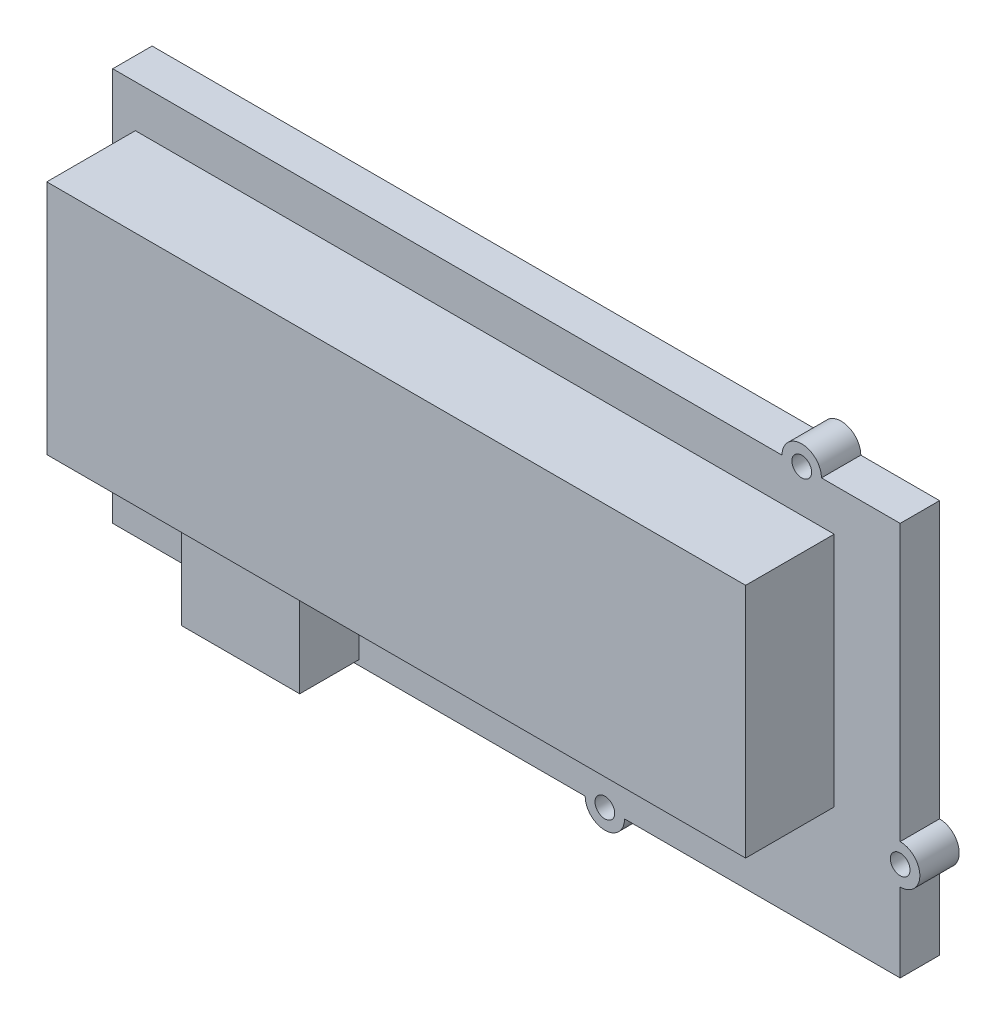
ISO-10303-21;
HEADER;
FILE_DESCRIPTION(('STEP AP214'),'2;1');
FILE_NAME('part.step','',(''),(''),'','','');
FILE_SCHEMA(('AUTOMOTIVE_DESIGN { 1 0 10303 214 1 1 1 1 }'));
ENDSEC;
DATA;
#1=APPLICATION_CONTEXT('core data for automotive mechanical design processes');
#2=APPLICATION_PROTOCOL_DEFINITION('international standard','automotive_design',2000,#1);
#3=PRODUCT_CONTEXT('',#1,'mechanical');
#4=PRODUCT('Part','Part','',(#3));
#5=PRODUCT_RELATED_PRODUCT_CATEGORY('part','',(#4));
#6=PRODUCT_DEFINITION_FORMATION('','',#4);
#7=PRODUCT_DEFINITION_CONTEXT('part definition',#1,'design');
#8=PRODUCT_DEFINITION('design','',#6,#7);
#9=PRODUCT_DEFINITION_SHAPE('','',#8);
#10=(LENGTH_UNIT() NAMED_UNIT(*) SI_UNIT(.MILLI.,.METRE.));
#11=(NAMED_UNIT(*) PLANE_ANGLE_UNIT() SI_UNIT($,.RADIAN.));
#12=(NAMED_UNIT(*) SI_UNIT($,.STERADIAN.) SOLID_ANGLE_UNIT());
#13=UNCERTAINTY_MEASURE_WITH_UNIT(LENGTH_MEASURE(1.E-05),#10,'distance_accuracy_value','');
#14=(GEOMETRIC_REPRESENTATION_CONTEXT(3) GLOBAL_UNCERTAINTY_ASSIGNED_CONTEXT((#13)) GLOBAL_UNIT_ASSIGNED_CONTEXT((#10,
#11,#12)) REPRESENTATION_CONTEXT('',''));
#15=CARTESIAN_POINT('',(0.,0.,0.));
#16=DIRECTION('',(0.,0.,1.));
#17=DIRECTION('',(1.,0.,0.));
#18=AXIS2_PLACEMENT_3D('',#15,#16,#17);
#19=CARTESIAN_POINT('',(0.,0.,4.));
#20=DIRECTION('',(0.,0.,-1.));
#21=DIRECTION('',(-1.,0.,0.));
#22=AXIS2_PLACEMENT_3D('',#19,#20,#21);
#23=PLANE('',#22);
#24=DIRECTION('',(0.,-1.,0.));
#25=VECTOR('',#24,1.);
#26=CARTESIAN_POINT('',(2.3,35.7,4.));
#27=LINE('',#26,#25);
#28=CARTESIAN_POINT('',(2.3,35.7,4.));
#29=VERTEX_POINT('',#28);
#30=CARTESIAN_POINT('',(2.3,11.7,4.));
#31=VERTEX_POINT('',#30);
#32=EDGE_CURVE('E205',#29,#31,#27,.T.);
#33=ORIENTED_EDGE('',*,*,#32,.F.);
#34=DIRECTION('',(-1.,0.,0.));
#35=VECTOR('',#34,1.);
#36=CARTESIAN_POINT('',(2.3,35.7,4.));
#37=LINE('',#36,#35);
#38=CARTESIAN_POINT('',(73.3,35.7,4.));
#39=VERTEX_POINT('',#38);
#40=EDGE_CURVE('E218',#39,#29,#37,.T.);
#41=ORIENTED_EDGE('',*,*,#40,.F.);
#42=DIRECTION('',(0.,1.,0.));
#43=VECTOR('',#42,1.);
#44=CARTESIAN_POINT('',(73.3,35.7,4.));
#45=LINE('',#44,#43);
#46=CARTESIAN_POINT('',(73.3,11.7,4.));
#47=VERTEX_POINT('',#46);
#48=EDGE_CURVE('E227',#47,#39,#45,.T.);
#49=ORIENTED_EDGE('',*,*,#48,.F.);
#50=DIRECTION('',(1.,0.,0.));
#51=VECTOR('',#50,1.);
#52=CARTESIAN_POINT('',(2.3,11.7,4.));
#53=LINE('',#52,#51);
#54=EDGE_CURVE('E208',#31,#47,#53,.T.);
#55=ORIENTED_EDGE('',*,*,#54,.F.);
#56=EDGE_LOOP('',(#33,#41,#49,#55));
#57=FACE_BOUND('',#56,.T.);
#58=CARTESIAN_POINT('',(50.,0.,4.));
#59=DIRECTION('',(0.,0.,1.));
#60=DIRECTION('',(1.,0.,0.));
#61=AXIS2_PLACEMENT_3D('',#58,#59,#60);
#62=CIRCLE('',#61,0.999999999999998);
#63=CARTESIAN_POINT('',(51.,0.,4.));
#64=VERTEX_POINT('',#63);
#65=EDGE_CURVE('E243',#64,#64,#62,.T.);
#66=ORIENTED_EDGE('',*,*,#65,.F.);
#67=EDGE_LOOP('',(#66));
#68=FACE_BOUND('',#67,.T.);
#69=CARTESIAN_POINT('',(10.,0.,4.));
#70=DIRECTION('',(0.,0.,1.));
#71=DIRECTION('',(1.,0.,0.));
#72=AXIS2_PLACEMENT_3D('',#69,#70,#71);
#73=CIRCLE('',#72,1.37675009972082);
#74=CARTESIAN_POINT('',(11.3767500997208,0.,4.));
#75=VERTEX_POINT('',#74);
#76=EDGE_CURVE('E247',#75,#75,#73,.T.);
#77=ORIENTED_EDGE('',*,*,#76,.F.);
#78=EDGE_LOOP('',(#77));
#79=FACE_BOUND('',#78,.T.);
#80=CARTESIAN_POINT('',(80.,10.,4.));
#81=DIRECTION('',(0.,0.,1.));
#82=DIRECTION('',(1.,0.,0.));
#83=AXIS2_PLACEMENT_3D('',#80,#81,#82);
#84=CIRCLE('',#83,0.999999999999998);
#85=CARTESIAN_POINT('',(81.,10.,4.));
#86=VERTEX_POINT('',#85);
#87=EDGE_CURVE('E253',#86,#86,#84,.T.);
#88=ORIENTED_EDGE('',*,*,#87,.F.);
#89=EDGE_LOOP('',(#88));
#90=FACE_BOUND('',#89,.T.);
#91=CARTESIAN_POINT('',(70.,40.,4.));
#92=DIRECTION('',(0.,0.,1.));
#93=DIRECTION('',(1.,0.,0.));
#94=AXIS2_PLACEMENT_3D('',#91,#92,#93);
#95=CIRCLE('',#94,0.999999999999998);
#96=CARTESIAN_POINT('',(71.,40.,4.));
#97=VERTEX_POINT('',#96);
#98=EDGE_CURVE('E259',#97,#97,#95,.T.);
#99=ORIENTED_EDGE('',*,*,#98,.F.);
#100=EDGE_LOOP('',(#99));
#101=FACE_BOUND('',#100,.T.);
#102=CARTESIAN_POINT('',(0.,30.,4.));
#103=DIRECTION('',(0.,0.,1.));
#104=DIRECTION('',(1.,0.,0.));
#105=AXIS2_PLACEMENT_3D('',#102,#103,#104);
#106=CIRCLE('',#105,1.);
#107=CARTESIAN_POINT('',(1.,30.,4.));
#108=VERTEX_POINT('',#107);
#109=EDGE_CURVE('E265',#108,#108,#106,.T.);
#110=ORIENTED_EDGE('',*,*,#109,.F.);
#111=EDGE_LOOP('',(#110));
#112=FACE_BOUND('',#111,.T.);
#113=DIRECTION('',(1.,0.,0.));
#114=VECTOR('',#113,1.);
#115=CARTESIAN_POINT('',(0.,0.,4.));
#116=LINE('',#115,#114);
#117=CARTESIAN_POINT('',(0.,0.,4.));
#118=VERTEX_POINT('',#117);
#119=CARTESIAN_POINT('',(8.,0.,4.));
#120=VERTEX_POINT('',#119);
#121=EDGE_CURVE('E329',#118,#120,#116,.T.);
#122=ORIENTED_EDGE('',*,*,#121,.T.);
#123=CARTESIAN_POINT('',(10.,0.,4.));
#124=DIRECTION('',(0.,0.,1.));
#125=DIRECTION('',(1.,0.,0.));
#126=AXIS2_PLACEMENT_3D('',#123,#124,#125);
#127=CIRCLE('',#126,2.);
#128=CARTESIAN_POINT('',(12.,0.,4.));
#129=VERTEX_POINT('',#128);
#130=EDGE_CURVE('E271',#120,#129,#127,.T.);
#131=ORIENTED_EDGE('',*,*,#130,.T.);
#132=CARTESIAN_POINT('',(48.,0.,4.));
#133=VERTEX_POINT('',#132);
#134=EDGE_CURVE('E333',#129,#133,#116,.T.);
#135=ORIENTED_EDGE('',*,*,#134,.T.);
#136=CARTESIAN_POINT('',(50.,0.,4.));
#137=DIRECTION('',(0.,0.,1.));
#138=DIRECTION('',(1.,0.,0.));
#139=AXIS2_PLACEMENT_3D('',#136,#137,#138);
#140=CIRCLE('',#139,2.);
#141=CARTESIAN_POINT('',(52.,0.,4.));
#142=VERTEX_POINT('',#141);
#143=EDGE_CURVE('E283',#133,#142,#140,.T.);
#144=ORIENTED_EDGE('',*,*,#143,.T.);
#145=CARTESIAN_POINT('',(80.,0.,4.));
#146=VERTEX_POINT('',#145);
#147=EDGE_CURVE('E327',#142,#146,#116,.T.);
#148=ORIENTED_EDGE('',*,*,#147,.T.);
#149=DIRECTION('',(0.,1.,0.));
#150=VECTOR('',#149,1.);
#151=CARTESIAN_POINT('',(80.,0.,4.));
#152=LINE('',#151,#150);
#153=CARTESIAN_POINT('',(80.,8.,4.));
#154=VERTEX_POINT('',#153);
#155=EDGE_CURVE('E334',#146,#154,#152,.T.);
#156=ORIENTED_EDGE('',*,*,#155,.T.);
#157=CARTESIAN_POINT('',(80.,10.,4.));
#158=DIRECTION('',(0.,0.,1.));
#159=DIRECTION('',(1.,0.,0.));
#160=AXIS2_PLACEMENT_3D('',#157,#158,#159);
#161=CIRCLE('',#160,2.);
#162=CARTESIAN_POINT('',(80.,12.,4.));
#163=VERTEX_POINT('',#162);
#164=EDGE_CURVE('E293',#154,#163,#161,.T.);
#165=ORIENTED_EDGE('',*,*,#164,.T.);
#166=CARTESIAN_POINT('',(80.,40.,4.));
#167=VERTEX_POINT('',#166);
#168=EDGE_CURVE('E332',#163,#167,#152,.T.);
#169=ORIENTED_EDGE('',*,*,#168,.T.);
#170=DIRECTION('',(-1.,0.,0.));
#171=VECTOR('',#170,1.);
#172=CARTESIAN_POINT('',(0.,40.,4.));
#173=LINE('',#172,#171);
#174=CARTESIAN_POINT('',(72.,40.,4.));
#175=VERTEX_POINT('',#174);
#176=EDGE_CURVE('E338',#167,#175,#173,.T.);
#177=ORIENTED_EDGE('',*,*,#176,.T.);
#178=CARTESIAN_POINT('',(70.,40.,4.));
#179=DIRECTION('',(0.,0.,1.));
#180=DIRECTION('',(1.,0.,0.));
#181=AXIS2_PLACEMENT_3D('',#178,#179,#180);
#182=CIRCLE('',#181,2.);
#183=CARTESIAN_POINT('',(68.,40.,4.));
#184=VERTEX_POINT('',#183);
#185=EDGE_CURVE('E303',#175,#184,#182,.T.);
#186=ORIENTED_EDGE('',*,*,#185,.T.);
#187=CARTESIAN_POINT('',(0.,40.,4.));
#188=VERTEX_POINT('',#187);
#189=EDGE_CURVE('E337',#184,#188,#173,.T.);
#190=ORIENTED_EDGE('',*,*,#189,.T.);
#191=DIRECTION('',(0.,-1.,0.));
#192=VECTOR('',#191,1.);
#193=CARTESIAN_POINT('',(0.,0.,4.));
#194=LINE('',#193,#192);
#195=CARTESIAN_POINT('',(0.,32.,4.));
#196=VERTEX_POINT('',#195);
#197=EDGE_CURVE('E324',#188,#196,#194,.T.);
#198=ORIENTED_EDGE('',*,*,#197,.T.);
#199=CARTESIAN_POINT('',(0.,30.,4.));
#200=DIRECTION('',(0.,0.,1.));
#201=DIRECTION('',(1.,0.,0.));
#202=AXIS2_PLACEMENT_3D('',#199,#200,#201);
#203=CIRCLE('',#202,2.);
#204=CARTESIAN_POINT('',(0.,28.,4.));
#205=VERTEX_POINT('',#204);
#206=EDGE_CURVE('E313',#196,#205,#203,.T.);
#207=ORIENTED_EDGE('',*,*,#206,.T.);
#208=EDGE_CURVE('E328',#205,#118,#194,.T.);
#209=ORIENTED_EDGE('',*,*,#208,.T.);
#210=EDGE_LOOP('',(#122,#131,#135,#144,#148,#156,#165,#169,#177,#186,#190,#198,#207,#209));
#211=FACE_BOUND('',#210,.T.);
#212=DIRECTION('',(0.,-1.,0.));
#213=VECTOR('',#212,1.);
#214=CARTESIAN_POINT('',(13.,10.5,4.));
#215=LINE('',#214,#213);
#216=CARTESIAN_POINT('',(13.,10.5,4.));
#217=VERTEX_POINT('',#216);
#218=CARTESIAN_POINT('',(13.,0.5,4.));
#219=VERTEX_POINT('',#218);
#220=EDGE_CURVE('E204',#217,#219,#215,.T.);
#221=ORIENTED_EDGE('',*,*,#220,.F.);
#222=DIRECTION('',(-1.,0.,0.));
#223=VECTOR('',#222,1.);
#224=CARTESIAN_POINT('',(13.,10.5,4.));
#225=LINE('',#224,#223);
#226=CARTESIAN_POINT('',(25.,10.5,4.));
#227=VERTEX_POINT('',#226);
#228=EDGE_CURVE('E201',#227,#217,#225,.T.);
#229=ORIENTED_EDGE('',*,*,#228,.F.);
#230=DIRECTION('',(0.,1.,0.));
#231=VECTOR('',#230,1.);
#232=CARTESIAN_POINT('',(25.,10.5,4.));
#233=LINE('',#232,#231);
#234=CARTESIAN_POINT('',(25.,0.5,4.));
#235=VERTEX_POINT('',#234);
#236=EDGE_CURVE('E55',#235,#227,#233,.T.);
#237=ORIENTED_EDGE('',*,*,#236,.F.);
#238=DIRECTION('',(1.,0.,0.));
#239=VECTOR('',#238,1.);
#240=CARTESIAN_POINT('',(13.,0.5,4.));
#241=LINE('',#240,#239);
#242=EDGE_CURVE('E50',#219,#235,#241,.T.);
#243=ORIENTED_EDGE('',*,*,#242,.F.);
#244=EDGE_LOOP('',(#221,#229,#237,#243));
#245=FACE_BOUND('',#244,.T.);
#246=ADVANCED_FACE('F35',(#57,#68,#79,#90,#101,#112,#211,#245),#23,.F.);
#247=CARTESIAN_POINT('',(0.,0.,4.));
#248=DIRECTION('',(0.,1.,0.));
#249=DIRECTION('',(0.,0.,1.));
#250=AXIS2_PLACEMENT_3D('',#247,#248,#249);
#251=PLANE('',#250);
#252=DIRECTION('',(1.,0.,0.));
#253=VECTOR('',#252,1.);
#254=CARTESIAN_POINT('',(0.,0.,0.));
#255=LINE('',#254,#253);
#256=CARTESIAN_POINT('',(0.,0.,0.));
#257=VERTEX_POINT('',#256);
#258=CARTESIAN_POINT('',(8.,0.,0.));
#259=VERTEX_POINT('',#258);
#260=EDGE_CURVE('E346',#257,#259,#255,.T.);
#261=ORIENTED_EDGE('',*,*,#260,.T.);
#262=DIRECTION('',(0.,0.,1.));
#263=VECTOR('',#262,1.);
#264=CARTESIAN_POINT('',(8.,0.,0.));
#265=LINE('',#264,#263);
#266=EDGE_CURVE('E280',#259,#120,#265,.T.);
#267=ORIENTED_EDGE('',*,*,#266,.T.);
#268=ORIENTED_EDGE('',*,*,#121,.F.);
#269=DIRECTION('',(0.,0.,-1.));
#270=VECTOR('',#269,1.);
#271=CARTESIAN_POINT('',(0.,0.,4.));
#272=LINE('',#271,#270);
#273=EDGE_CURVE('E11',#118,#257,#272,.T.);
#274=ORIENTED_EDGE('',*,*,#273,.T.);
#275=EDGE_LOOP('',(#261,#267,#268,#274));
#276=FACE_BOUND('',#275,.T.);
#277=ADVANCED_FACE('F399',(#276),#251,.F.);
#278=ORIENTED_EDGE('',*,*,#134,.F.);
#279=DIRECTION('',(0.,0.,1.));
#280=VECTOR('',#279,1.);
#281=CARTESIAN_POINT('',(12.,0.,0.));
#282=LINE('',#281,#280);
#283=CARTESIAN_POINT('',(12.,0.,0.));
#284=VERTEX_POINT('',#283);
#285=EDGE_CURVE('E276',#129,#284,#282,.F.);
#286=ORIENTED_EDGE('',*,*,#285,.T.);
#287=CARTESIAN_POINT('',(48.,0.,0.));
#288=VERTEX_POINT('',#287);
#289=EDGE_CURVE('E350',#284,#288,#255,.T.);
#290=ORIENTED_EDGE('',*,*,#289,.T.);
#291=DIRECTION('',(0.,0.,1.));
#292=VECTOR('',#291,1.);
#293=CARTESIAN_POINT('',(48.,0.,0.));
#294=LINE('',#293,#292);
#295=EDGE_CURVE('E290',#288,#133,#294,.T.);
#296=ORIENTED_EDGE('',*,*,#295,.T.);
#297=EDGE_LOOP('',(#278,#286,#290,#296));
#298=FACE_BOUND('',#297,.T.);
#299=ADVANCED_FACE('F395',(#298),#251,.F.);
#300=CARTESIAN_POINT('',(80.,0.,4.));
#301=DIRECTION('',(-1.,0.,0.));
#302=DIRECTION('',(0.,0.,1.));
#303=AXIS2_PLACEMENT_3D('',#300,#301,#302);
#304=PLANE('',#303);
#305=DIRECTION('',(0.,1.,0.));
#306=VECTOR('',#305,1.);
#307=CARTESIAN_POINT('',(80.,0.,0.));
#308=LINE('',#307,#306);
#309=CARTESIAN_POINT('',(80.,0.,0.));
#310=VERTEX_POINT('',#309);
#311=CARTESIAN_POINT('',(80.,8.,0.));
#312=VERTEX_POINT('',#311);
#313=EDGE_CURVE('E351',#310,#312,#308,.T.);
#314=ORIENTED_EDGE('',*,*,#313,.T.);
#315=DIRECTION('',(0.,0.,1.));
#316=VECTOR('',#315,1.);
#317=CARTESIAN_POINT('',(80.,8.,0.));
#318=LINE('',#317,#316);
#319=EDGE_CURVE('E300',#312,#154,#318,.T.);
#320=ORIENTED_EDGE('',*,*,#319,.T.);
#321=ORIENTED_EDGE('',*,*,#155,.F.);
#322=DIRECTION('',(0.,0.,-1.));
#323=VECTOR('',#322,1.);
#324=CARTESIAN_POINT('',(80.,0.,4.));
#325=LINE('',#324,#323);
#326=EDGE_CURVE('E43',#146,#310,#325,.T.);
#327=ORIENTED_EDGE('',*,*,#326,.T.);
#328=EDGE_LOOP('',(#314,#320,#321,#327));
#329=FACE_BOUND('',#328,.T.);
#330=ADVANCED_FACE('F367',(#329),#304,.F.);
#331=CARTESIAN_POINT('',(0.,40.,4.));
#332=DIRECTION('',(0.,-1.,0.));
#333=DIRECTION('',(0.,0.,-1.));
#334=AXIS2_PLACEMENT_3D('',#331,#332,#333);
#335=PLANE('',#334);
#336=DIRECTION('',(-1.,0.,0.));
#337=VECTOR('',#336,1.);
#338=CARTESIAN_POINT('',(0.,40.,0.));
#339=LINE('',#338,#337);
#340=CARTESIAN_POINT('',(80.,40.,0.));
#341=VERTEX_POINT('',#340);
#342=CARTESIAN_POINT('',(72.,40.,0.));
#343=VERTEX_POINT('',#342);
#344=EDGE_CURVE('E355',#341,#343,#339,.T.);
#345=ORIENTED_EDGE('',*,*,#344,.T.);
#346=DIRECTION('',(0.,0.,1.));
#347=VECTOR('',#346,1.);
#348=CARTESIAN_POINT('',(72.,40.,0.));
#349=LINE('',#348,#347);
#350=EDGE_CURVE('E310',#343,#175,#349,.T.);
#351=ORIENTED_EDGE('',*,*,#350,.T.);
#352=ORIENTED_EDGE('',*,*,#176,.F.);
#353=DIRECTION('',(0.,0.,-1.));
#354=VECTOR('',#353,1.);
#355=CARTESIAN_POINT('',(80.,40.,4.));
#356=LINE('',#355,#354);
#357=EDGE_CURVE('E360',#167,#341,#356,.T.);
#358=ORIENTED_EDGE('',*,*,#357,.T.);
#359=EDGE_LOOP('',(#345,#351,#352,#358));
#360=FACE_BOUND('',#359,.T.);
#361=ADVANCED_FACE('F426',(#360),#335,.F.);
#362=CARTESIAN_POINT('',(0.,0.,4.));
#363=DIRECTION('',(1.,0.,0.));
#364=DIRECTION('',(0.,0.,-1.));
#365=AXIS2_PLACEMENT_3D('',#362,#363,#364);
#366=PLANE('',#365);
#367=DIRECTION('',(0.,-1.,0.));
#368=VECTOR('',#367,1.);
#369=CARTESIAN_POINT('',(0.,0.,0.));
#370=LINE('',#369,#368);
#371=CARTESIAN_POINT('',(0.,40.,0.));
#372=VERTEX_POINT('',#371);
#373=CARTESIAN_POINT('',(0.,32.,0.));
#374=VERTEX_POINT('',#373);
#375=EDGE_CURVE('E342',#372,#374,#370,.T.);
#376=ORIENTED_EDGE('',*,*,#375,.T.);
#377=DIRECTION('',(0.,0.,1.));
#378=VECTOR('',#377,1.);
#379=CARTESIAN_POINT('',(0.,32.,0.));
#380=LINE('',#379,#378);
#381=EDGE_CURVE('E320',#374,#196,#380,.T.);
#382=ORIENTED_EDGE('',*,*,#381,.T.);
#383=ORIENTED_EDGE('',*,*,#197,.F.);
#384=DIRECTION('',(0.,0.,-1.));
#385=VECTOR('',#384,1.);
#386=CARTESIAN_POINT('',(0.,40.,4.));
#387=LINE('',#386,#385);
#388=EDGE_CURVE('E341',#188,#372,#387,.T.);
#389=ORIENTED_EDGE('',*,*,#388,.T.);
#390=EDGE_LOOP('',(#376,#382,#383,#389));
#391=FACE_BOUND('',#390,.T.);
#392=ADVANCED_FACE('F406',(#391),#366,.F.);
#393=ORIENTED_EDGE('',*,*,#208,.F.);
#394=DIRECTION('',(0.,0.,1.));
#395=VECTOR('',#394,1.);
#396=CARTESIAN_POINT('',(0.,28.,0.));
#397=LINE('',#396,#395);
#398=CARTESIAN_POINT('',(0.,28.,0.));
#399=VERTEX_POINT('',#398);
#400=EDGE_CURVE('E316',#205,#399,#397,.F.);
#401=ORIENTED_EDGE('',*,*,#400,.T.);
#402=EDGE_CURVE('E323',#399,#257,#370,.T.);
#403=ORIENTED_EDGE('',*,*,#402,.T.);
#404=ORIENTED_EDGE('',*,*,#273,.F.);
#405=EDGE_LOOP('',(#393,#401,#403,#404));
#406=FACE_BOUND('',#405,.T.);
#407=ADVANCED_FACE('F37',(#406),#366,.F.);
#408=ORIENTED_EDGE('',*,*,#147,.F.);
#409=DIRECTION('',(0.,0.,1.));
#410=VECTOR('',#409,1.);
#411=CARTESIAN_POINT('',(52.,0.,0.));
#412=LINE('',#411,#410);
#413=CARTESIAN_POINT('',(52.,0.,0.));
#414=VERTEX_POINT('',#413);
#415=EDGE_CURVE('E286',#142,#414,#412,.F.);
#416=ORIENTED_EDGE('',*,*,#415,.T.);
#417=EDGE_CURVE('E345',#414,#310,#255,.T.);
#418=ORIENTED_EDGE('',*,*,#417,.T.);
#419=ORIENTED_EDGE('',*,*,#326,.F.);
#420=EDGE_LOOP('',(#408,#416,#418,#419));
#421=FACE_BOUND('',#420,.T.);
#422=ADVANCED_FACE('F397',(#421),#251,.F.);
#423=ORIENTED_EDGE('',*,*,#168,.F.);
#424=DIRECTION('',(0.,0.,1.));
#425=VECTOR('',#424,1.);
#426=CARTESIAN_POINT('',(80.,12.,0.));
#427=LINE('',#426,#425);
#428=CARTESIAN_POINT('',(80.,12.,0.));
#429=VERTEX_POINT('',#428);
#430=EDGE_CURVE('E296',#163,#429,#427,.F.);
#431=ORIENTED_EDGE('',*,*,#430,.T.);
#432=EDGE_CURVE('E349',#429,#341,#308,.T.);
#433=ORIENTED_EDGE('',*,*,#432,.T.);
#434=ORIENTED_EDGE('',*,*,#357,.F.);
#435=EDGE_LOOP('',(#423,#431,#433,#434));
#436=FACE_BOUND('',#435,.T.);
#437=ADVANCED_FACE('F383',(#436),#304,.F.);
#438=ORIENTED_EDGE('',*,*,#189,.F.);
#439=DIRECTION('',(0.,0.,1.));
#440=VECTOR('',#439,1.);
#441=CARTESIAN_POINT('',(68.,40.,0.));
#442=LINE('',#441,#440);
#443=CARTESIAN_POINT('',(68.,40.,0.));
#444=VERTEX_POINT('',#443);
#445=EDGE_CURVE('E306',#184,#444,#442,.F.);
#446=ORIENTED_EDGE('',*,*,#445,.T.);
#447=EDGE_CURVE('E354',#444,#372,#339,.T.);
#448=ORIENTED_EDGE('',*,*,#447,.T.);
#449=ORIENTED_EDGE('',*,*,#388,.F.);
#450=EDGE_LOOP('',(#438,#446,#448,#449));
#451=FACE_BOUND('',#450,.T.);
#452=ADVANCED_FACE('F404',(#451),#335,.F.);
#453=CARTESIAN_POINT('',(0.,0.,0.));
#454=DIRECTION('',(0.,0.,-1.));
#455=DIRECTION('',(-1.,0.,0.));
#456=AXIS2_PLACEMENT_3D('',#453,#454,#455);
#457=PLANE('',#456);
#458=CARTESIAN_POINT('',(50.,0.,0.));
#459=DIRECTION('',(0.,0.,1.));
#460=DIRECTION('',(1.,0.,0.));
#461=AXIS2_PLACEMENT_3D('',#458,#459,#460);
#462=CIRCLE('',#461,0.999999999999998);
#463=CARTESIAN_POINT('',(51.,0.,0.));
#464=VERTEX_POINT('',#463);
#465=EDGE_CURVE('E244',#464,#464,#462,.T.);
#466=ORIENTED_EDGE('',*,*,#465,.T.);
#467=EDGE_LOOP('',(#466));
#468=FACE_BOUND('',#467,.T.);
#469=CARTESIAN_POINT('',(10.,0.,0.));
#470=DIRECTION('',(0.,0.,1.));
#471=DIRECTION('',(1.,0.,0.));
#472=AXIS2_PLACEMENT_3D('',#469,#470,#471);
#473=CIRCLE('',#472,1.37675009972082);
#474=CARTESIAN_POINT('',(11.3767500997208,0.,0.));
#475=VERTEX_POINT('',#474);
#476=EDGE_CURVE('E250',#475,#475,#473,.T.);
#477=ORIENTED_EDGE('',*,*,#476,.T.);
#478=EDGE_LOOP('',(#477));
#479=FACE_BOUND('',#478,.T.);
#480=CARTESIAN_POINT('',(80.,10.,0.));
#481=DIRECTION('',(0.,0.,1.));
#482=DIRECTION('',(1.,0.,0.));
#483=AXIS2_PLACEMENT_3D('',#480,#481,#482);
#484=CIRCLE('',#483,0.999999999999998);
#485=CARTESIAN_POINT('',(81.,10.,0.));
#486=VERTEX_POINT('',#485);
#487=EDGE_CURVE('E256',#486,#486,#484,.T.);
#488=ORIENTED_EDGE('',*,*,#487,.T.);
#489=EDGE_LOOP('',(#488));
#490=FACE_BOUND('',#489,.T.);
#491=CARTESIAN_POINT('',(70.,40.,0.));
#492=DIRECTION('',(0.,0.,1.));
#493=DIRECTION('',(1.,0.,0.));
#494=AXIS2_PLACEMENT_3D('',#491,#492,#493);
#495=CIRCLE('',#494,0.999999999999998);
#496=CARTESIAN_POINT('',(71.,40.,0.));
#497=VERTEX_POINT('',#496);
#498=EDGE_CURVE('E262',#497,#497,#495,.T.);
#499=ORIENTED_EDGE('',*,*,#498,.T.);
#500=EDGE_LOOP('',(#499));
#501=FACE_BOUND('',#500,.T.);
#502=CARTESIAN_POINT('',(0.,30.,0.));
#503=DIRECTION('',(0.,0.,1.));
#504=DIRECTION('',(1.,0.,0.));
#505=AXIS2_PLACEMENT_3D('',#502,#503,#504);
#506=CIRCLE('',#505,1.);
#507=CARTESIAN_POINT('',(1.,30.,0.));
#508=VERTEX_POINT('',#507);
#509=EDGE_CURVE('E268',#508,#508,#506,.T.);
#510=ORIENTED_EDGE('',*,*,#509,.T.);
#511=EDGE_LOOP('',(#510));
#512=FACE_BOUND('',#511,.T.);
#513=ORIENTED_EDGE('',*,*,#289,.F.);
#514=CARTESIAN_POINT('',(10.,0.,0.));
#515=DIRECTION('',(0.,0.,1.));
#516=DIRECTION('',(1.,0.,0.));
#517=AXIS2_PLACEMENT_3D('',#514,#515,#516);
#518=CIRCLE('',#517,2.);
#519=EDGE_CURVE('E274',#259,#284,#518,.T.);
#520=ORIENTED_EDGE('',*,*,#519,.F.);
#521=ORIENTED_EDGE('',*,*,#260,.F.);
#522=ORIENTED_EDGE('',*,*,#402,.F.);
#523=CARTESIAN_POINT('',(0.,30.,0.));
#524=DIRECTION('',(0.,0.,1.));
#525=DIRECTION('',(1.,0.,0.));
#526=AXIS2_PLACEMENT_3D('',#523,#524,#525);
#527=CIRCLE('',#526,2.);
#528=EDGE_CURVE('E314',#374,#399,#527,.T.);
#529=ORIENTED_EDGE('',*,*,#528,.F.);
#530=ORIENTED_EDGE('',*,*,#375,.F.);
#531=ORIENTED_EDGE('',*,*,#447,.F.);
#532=CARTESIAN_POINT('',(70.,40.,0.));
#533=DIRECTION('',(0.,0.,1.));
#534=DIRECTION('',(1.,0.,0.));
#535=AXIS2_PLACEMENT_3D('',#532,#533,#534);
#536=CIRCLE('',#535,2.);
#537=EDGE_CURVE('E304',#343,#444,#536,.T.);
#538=ORIENTED_EDGE('',*,*,#537,.F.);
#539=ORIENTED_EDGE('',*,*,#344,.F.);
#540=ORIENTED_EDGE('',*,*,#432,.F.);
#541=CARTESIAN_POINT('',(80.,10.,0.));
#542=DIRECTION('',(0.,0.,1.));
#543=DIRECTION('',(1.,0.,0.));
#544=AXIS2_PLACEMENT_3D('',#541,#542,#543);
#545=CIRCLE('',#544,2.);
#546=EDGE_CURVE('E294',#312,#429,#545,.T.);
#547=ORIENTED_EDGE('',*,*,#546,.F.);
#548=ORIENTED_EDGE('',*,*,#313,.F.);
#549=ORIENTED_EDGE('',*,*,#417,.F.);
#550=CARTESIAN_POINT('',(50.,0.,0.));
#551=DIRECTION('',(0.,0.,1.));
#552=DIRECTION('',(1.,0.,0.));
#553=AXIS2_PLACEMENT_3D('',#550,#551,#552);
#554=CIRCLE('',#553,2.);
#555=EDGE_CURVE('E284',#288,#414,#554,.T.);
#556=ORIENTED_EDGE('',*,*,#555,.F.);
#557=EDGE_LOOP('',(#513,#520,#521,#522,#529,#530,#531,#538,#539,#540,#547,#548,#549,#556));
#558=FACE_BOUND('',#557,.T.);
#559=ADVANCED_FACE('F374',(#468,#479,#490,#501,#512,#558),#457,.T.);
#560=CARTESIAN_POINT('',(0.,30.,0.));
#561=DIRECTION('',(0.,0.,1.));
#562=DIRECTION('',(1.,0.,0.));
#563=AXIS2_PLACEMENT_3D('',#560,#561,#562);
#564=CYLINDRICAL_SURFACE('',#563,2.);
#565=ORIENTED_EDGE('',*,*,#381,.F.);
#566=ORIENTED_EDGE('',*,*,#528,.T.);
#567=ORIENTED_EDGE('',*,*,#400,.F.);
#568=ORIENTED_EDGE('',*,*,#206,.F.);
#569=EDGE_LOOP('',(#565,#566,#567,#568));
#570=FACE_BOUND('',#569,.T.);
#571=ADVANCED_FACE('F419',(#570),#564,.T.);
#572=CARTESIAN_POINT('',(70.,40.,0.));
#573=DIRECTION('',(0.,0.,1.));
#574=DIRECTION('',(1.,0.,0.));
#575=AXIS2_PLACEMENT_3D('',#572,#573,#574);
#576=CYLINDRICAL_SURFACE('',#575,2.);
#577=ORIENTED_EDGE('',*,*,#350,.F.);
#578=ORIENTED_EDGE('',*,*,#537,.T.);
#579=ORIENTED_EDGE('',*,*,#445,.F.);
#580=ORIENTED_EDGE('',*,*,#185,.F.);
#581=EDGE_LOOP('',(#577,#578,#579,#580));
#582=FACE_BOUND('',#581,.T.);
#583=ADVANCED_FACE('F442',(#582),#576,.T.);
#584=CARTESIAN_POINT('',(80.,10.,0.));
#585=DIRECTION('',(0.,0.,1.));
#586=DIRECTION('',(1.,0.,0.));
#587=AXIS2_PLACEMENT_3D('',#584,#585,#586);
#588=CYLINDRICAL_SURFACE('',#587,2.);
#589=ORIENTED_EDGE('',*,*,#319,.F.);
#590=ORIENTED_EDGE('',*,*,#546,.T.);
#591=ORIENTED_EDGE('',*,*,#430,.F.);
#592=ORIENTED_EDGE('',*,*,#164,.F.);
#593=EDGE_LOOP('',(#589,#590,#591,#592));
#594=FACE_BOUND('',#593,.T.);
#595=ADVANCED_FACE('F380',(#594),#588,.T.);
#596=CARTESIAN_POINT('',(50.,0.,0.));
#597=DIRECTION('',(0.,0.,1.));
#598=DIRECTION('',(1.,0.,0.));
#599=AXIS2_PLACEMENT_3D('',#596,#597,#598);
#600=CYLINDRICAL_SURFACE('',#599,2.);
#601=ORIENTED_EDGE('',*,*,#295,.F.);
#602=ORIENTED_EDGE('',*,*,#555,.T.);
#603=ORIENTED_EDGE('',*,*,#415,.F.);
#604=ORIENTED_EDGE('',*,*,#143,.F.);
#605=EDGE_LOOP('',(#601,#602,#603,#604));
#606=FACE_BOUND('',#605,.T.);
#607=ADVANCED_FACE('F394',(#606),#600,.T.);
#608=CARTESIAN_POINT('',(10.,0.,0.));
#609=DIRECTION('',(0.,0.,1.));
#610=DIRECTION('',(1.,0.,0.));
#611=AXIS2_PLACEMENT_3D('',#608,#609,#610);
#612=CYLINDRICAL_SURFACE('',#611,2.);
#613=ORIENTED_EDGE('',*,*,#266,.F.);
#614=ORIENTED_EDGE('',*,*,#519,.T.);
#615=ORIENTED_EDGE('',*,*,#285,.F.);
#616=ORIENTED_EDGE('',*,*,#130,.F.);
#617=EDGE_LOOP('',(#613,#614,#615,#616));
#618=FACE_BOUND('',#617,.T.);
#619=ADVANCED_FACE('F454',(#618),#612,.T.);
#620=CARTESIAN_POINT('',(0.,30.,0.));
#621=DIRECTION('',(0.,0.,1.));
#622=DIRECTION('',(1.,0.,0.));
#623=AXIS2_PLACEMENT_3D('',#620,#621,#622);
#624=CYLINDRICAL_SURFACE('',#623,1.);
#625=ORIENTED_EDGE('',*,*,#509,.F.);
#626=EDGE_LOOP('',(#625));
#627=FACE_BOUND('',#626,.T.);
#628=ORIENTED_EDGE('',*,*,#109,.T.);
#629=EDGE_LOOP('',(#628));
#630=FACE_BOUND('',#629,.T.);
#631=ADVANCED_FACE('F456',(#627,#630),#624,.F.);
#632=CARTESIAN_POINT('',(70.,40.,0.));
#633=DIRECTION('',(0.,0.,1.));
#634=DIRECTION('',(1.,0.,0.));
#635=AXIS2_PLACEMENT_3D('',#632,#633,#634);
#636=CYLINDRICAL_SURFACE('',#635,0.999999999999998);
#637=ORIENTED_EDGE('',*,*,#498,.F.);
#638=EDGE_LOOP('',(#637));
#639=FACE_BOUND('',#638,.T.);
#640=ORIENTED_EDGE('',*,*,#98,.T.);
#641=EDGE_LOOP('',(#640));
#642=FACE_BOUND('',#641,.T.);
#643=ADVANCED_FACE('F462',(#639,#642),#636,.F.);
#644=CARTESIAN_POINT('',(80.,10.,0.));
#645=DIRECTION('',(0.,0.,1.));
#646=DIRECTION('',(1.,0.,0.));
#647=AXIS2_PLACEMENT_3D('',#644,#645,#646);
#648=CYLINDRICAL_SURFACE('',#647,0.999999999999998);
#649=ORIENTED_EDGE('',*,*,#487,.F.);
#650=EDGE_LOOP('',(#649));
#651=FACE_BOUND('',#650,.T.);
#652=ORIENTED_EDGE('',*,*,#87,.T.);
#653=EDGE_LOOP('',(#652));
#654=FACE_BOUND('',#653,.T.);
#655=ADVANCED_FACE('F498',(#651,#654),#648,.F.);
#656=CARTESIAN_POINT('',(10.,0.,0.));
#657=DIRECTION('',(0.,0.,1.));
#658=DIRECTION('',(1.,0.,0.));
#659=AXIS2_PLACEMENT_3D('',#656,#657,#658);
#660=CYLINDRICAL_SURFACE('',#659,1.37675009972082);
#661=ORIENTED_EDGE('',*,*,#476,.F.);
#662=EDGE_LOOP('',(#661));
#663=FACE_BOUND('',#662,.T.);
#664=ORIENTED_EDGE('',*,*,#76,.T.);
#665=EDGE_LOOP('',(#664));
#666=FACE_BOUND('',#665,.T.);
#667=ADVANCED_FACE('F507',(#663,#666),#660,.F.);
#668=CARTESIAN_POINT('',(50.,0.,0.));
#669=DIRECTION('',(0.,0.,1.));
#670=DIRECTION('',(1.,0.,0.));
#671=AXIS2_PLACEMENT_3D('',#668,#669,#670);
#672=CYLINDRICAL_SURFACE('',#671,0.999999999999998);
#673=ORIENTED_EDGE('',*,*,#465,.F.);
#674=EDGE_LOOP('',(#673));
#675=FACE_BOUND('',#674,.T.);
#676=ORIENTED_EDGE('',*,*,#65,.T.);
#677=EDGE_LOOP('',(#676));
#678=FACE_BOUND('',#677,.T.);
#679=ADVANCED_FACE('F517',(#675,#678),#672,.F.);
#680=CARTESIAN_POINT('',(2.3,35.7,13.));
#681=DIRECTION('',(1.,0.,0.));
#682=DIRECTION('',(0.,1.,0.));
#683=AXIS2_PLACEMENT_3D('',#680,#681,#682);
#684=PLANE('',#683);
#685=ORIENTED_EDGE('',*,*,#32,.T.);
#686=DIRECTION('',(0.,0.,-1.));
#687=VECTOR('',#686,1.);
#688=CARTESIAN_POINT('',(2.3,11.7,13.));
#689=LINE('',#688,#687);
#690=CARTESIAN_POINT('',(2.3,11.7,13.));
#691=VERTEX_POINT('',#690);
#692=EDGE_CURVE('E240',#691,#31,#689,.T.);
#693=ORIENTED_EDGE('',*,*,#692,.F.);
#694=DIRECTION('',(0.,-1.,0.));
#695=VECTOR('',#694,1.);
#696=CARTESIAN_POINT('',(2.3,35.7,13.));
#697=LINE('',#696,#695);
#698=CARTESIAN_POINT('',(2.3,35.7,13.));
#699=VERTEX_POINT('',#698);
#700=EDGE_CURVE('E214',#699,#691,#697,.T.);
#701=ORIENTED_EDGE('',*,*,#700,.F.);
#702=DIRECTION('',(0.,0.,-1.));
#703=VECTOR('',#702,1.);
#704=CARTESIAN_POINT('',(2.3,35.7,13.));
#705=LINE('',#704,#703);
#706=EDGE_CURVE('E223',#699,#29,#705,.T.);
#707=ORIENTED_EDGE('',*,*,#706,.T.);
#708=EDGE_LOOP('',(#685,#693,#701,#707));
#709=FACE_BOUND('',#708,.T.);
#710=ADVANCED_FACE('F527',(#709),#684,.F.);
#711=CARTESIAN_POINT('',(2.3,11.7,13.));
#712=DIRECTION('',(0.,1.,0.));
#713=DIRECTION('',(0.,0.,1.));
#714=AXIS2_PLACEMENT_3D('',#711,#712,#713);
#715=PLANE('',#714);
#716=ORIENTED_EDGE('',*,*,#54,.T.);
#717=DIRECTION('',(0.,0.,-1.));
#718=VECTOR('',#717,1.);
#719=CARTESIAN_POINT('',(73.3,11.7,13.));
#720=LINE('',#719,#718);
#721=CARTESIAN_POINT('',(73.3,11.7,13.));
#722=VERTEX_POINT('',#721);
#723=EDGE_CURVE('E237',#722,#47,#720,.T.);
#724=ORIENTED_EDGE('',*,*,#723,.F.);
#725=DIRECTION('',(1.,0.,0.));
#726=VECTOR('',#725,1.);
#727=CARTESIAN_POINT('',(2.3,11.7,13.));
#728=LINE('',#727,#726);
#729=EDGE_CURVE('E217',#691,#722,#728,.T.);
#730=ORIENTED_EDGE('',*,*,#729,.F.);
#731=ORIENTED_EDGE('',*,*,#692,.T.);
#732=EDGE_LOOP('',(#716,#724,#730,#731));
#733=FACE_BOUND('',#732,.T.);
#734=ADVANCED_FACE('F538',(#733),#715,.F.);
#735=CARTESIAN_POINT('',(73.3,35.7,13.));
#736=DIRECTION('',(-1.,0.,0.));
#737=DIRECTION('',(0.,0.,1.));
#738=AXIS2_PLACEMENT_3D('',#735,#736,#737);
#739=PLANE('',#738);
#740=ORIENTED_EDGE('',*,*,#48,.T.);
#741=DIRECTION('',(0.,0.,-1.));
#742=VECTOR('',#741,1.);
#743=CARTESIAN_POINT('',(73.3,35.7,13.));
#744=LINE('',#743,#742);
#745=CARTESIAN_POINT('',(73.3,35.7,13.));
#746=VERTEX_POINT('',#745);
#747=EDGE_CURVE('E234',#746,#39,#744,.T.);
#748=ORIENTED_EDGE('',*,*,#747,.F.);
#749=DIRECTION('',(0.,1.,0.));
#750=VECTOR('',#749,1.);
#751=CARTESIAN_POINT('',(73.3,35.7,13.));
#752=LINE('',#751,#750);
#753=EDGE_CURVE('E220',#722,#746,#752,.T.);
#754=ORIENTED_EDGE('',*,*,#753,.F.);
#755=ORIENTED_EDGE('',*,*,#723,.T.);
#756=EDGE_LOOP('',(#740,#748,#754,#755));
#757=FACE_BOUND('',#756,.T.);
#758=ADVANCED_FACE('F550',(#757),#739,.F.);
#759=CARTESIAN_POINT('',(2.3,35.7,13.));
#760=DIRECTION('',(0.,-1.,0.));
#761=DIRECTION('',(1.,0.,0.));
#762=AXIS2_PLACEMENT_3D('',#759,#760,#761);
#763=PLANE('',#762);
#764=ORIENTED_EDGE('',*,*,#40,.T.);
#765=ORIENTED_EDGE('',*,*,#706,.F.);
#766=DIRECTION('',(-1.,0.,0.));
#767=VECTOR('',#766,1.);
#768=CARTESIAN_POINT('',(2.3,35.7,13.));
#769=LINE('',#768,#767);
#770=EDGE_CURVE('E222',#746,#699,#769,.T.);
#771=ORIENTED_EDGE('',*,*,#770,.F.);
#772=ORIENTED_EDGE('',*,*,#747,.T.);
#773=EDGE_LOOP('',(#764,#765,#771,#772));
#774=FACE_BOUND('',#773,.T.);
#775=ADVANCED_FACE('F561',(#774),#763,.F.);
#776=CARTESIAN_POINT('',(0.,0.,13.));
#777=DIRECTION('',(0.,0.,1.));
#778=DIRECTION('',(1.,0.,0.));
#779=AXIS2_PLACEMENT_3D('',#776,#777,#778);
#780=PLANE('',#779);
#781=ORIENTED_EDGE('',*,*,#700,.T.);
#782=ORIENTED_EDGE('',*,*,#729,.T.);
#783=ORIENTED_EDGE('',*,*,#753,.T.);
#784=ORIENTED_EDGE('',*,*,#770,.T.);
#785=EDGE_LOOP('',(#781,#782,#783,#784));
#786=FACE_BOUND('',#785,.T.);
#787=ADVANCED_FACE('F572',(#786),#780,.T.);
#788=CARTESIAN_POINT('',(13.,10.5,10.));
#789=DIRECTION('',(1.,0.,0.));
#790=DIRECTION('',(0.,1.,0.));
#791=AXIS2_PLACEMENT_3D('',#788,#789,#790);
#792=PLANE('',#791);
#793=ORIENTED_EDGE('',*,*,#220,.T.);
#794=DIRECTION('',(0.,0.,-1.));
#795=VECTOR('',#794,1.);
#796=CARTESIAN_POINT('',(13.,0.5,10.));
#797=LINE('',#796,#795);
#798=CARTESIAN_POINT('',(13.,0.5,10.));
#799=VERTEX_POINT('',#798);
#800=EDGE_CURVE('E185',#799,#219,#797,.T.);
#801=ORIENTED_EDGE('',*,*,#800,.F.);
#802=DIRECTION('',(0.,-1.,0.));
#803=VECTOR('',#802,1.);
#804=CARTESIAN_POINT('',(13.,10.5,10.));
#805=LINE('',#804,#803);
#806=CARTESIAN_POINT('',(13.,10.5,10.));
#807=VERTEX_POINT('',#806);
#808=EDGE_CURVE('E192',#807,#799,#805,.T.);
#809=ORIENTED_EDGE('',*,*,#808,.F.);
#810=DIRECTION('',(0.,0.,-1.));
#811=VECTOR('',#810,1.);
#812=CARTESIAN_POINT('',(13.,10.5,10.));
#813=LINE('',#812,#811);
#814=EDGE_CURVE('E638',#807,#217,#813,.T.);
#815=ORIENTED_EDGE('',*,*,#814,.T.);
#816=EDGE_LOOP('',(#793,#801,#809,#815));
#817=FACE_BOUND('',#816,.T.);
#818=ADVANCED_FACE('F203',(#817),#792,.F.);
#819=CARTESIAN_POINT('',(13.,0.5,10.));
#820=DIRECTION('',(0.,1.,0.));
#821=DIRECTION('',(-1.,0.,0.));
#822=AXIS2_PLACEMENT_3D('',#819,#820,#821);
#823=PLANE('',#822);
#824=ORIENTED_EDGE('',*,*,#242,.T.);
#825=DIRECTION('',(0.,0.,-1.));
#826=VECTOR('',#825,1.);
#827=CARTESIAN_POINT('',(25.,0.5,10.));
#828=LINE('',#827,#826);
#829=CARTESIAN_POINT('',(25.,0.5,10.));
#830=VERTEX_POINT('',#829);
#831=EDGE_CURVE('E188',#830,#235,#828,.T.);
#832=ORIENTED_EDGE('',*,*,#831,.F.);
#833=DIRECTION('',(1.,0.,0.));
#834=VECTOR('',#833,1.);
#835=CARTESIAN_POINT('',(13.,0.5,10.));
#836=LINE('',#835,#834);
#837=EDGE_CURVE('E181',#799,#830,#836,.T.);
#838=ORIENTED_EDGE('',*,*,#837,.F.);
#839=ORIENTED_EDGE('',*,*,#800,.T.);
#840=EDGE_LOOP('',(#824,#832,#838,#839));
#841=FACE_BOUND('',#840,.T.);
#842=ADVANCED_FACE('F183',(#841),#823,.F.);
#843=CARTESIAN_POINT('',(25.,10.5,10.));
#844=DIRECTION('',(-1.,0.,0.));
#845=DIRECTION('',(0.,-1.,0.));
#846=AXIS2_PLACEMENT_3D('',#843,#844,#845);
#847=PLANE('',#846);
#848=ORIENTED_EDGE('',*,*,#236,.T.);
#849=DIRECTION('',(0.,0.,-1.));
#850=VECTOR('',#849,1.);
#851=CARTESIAN_POINT('',(25.,10.5,10.));
#852=LINE('',#851,#850);
#853=CARTESIAN_POINT('',(25.,10.5,10.));
#854=VERTEX_POINT('',#853);
#855=EDGE_CURVE('E210',#854,#227,#852,.T.);
#856=ORIENTED_EDGE('',*,*,#855,.F.);
#857=DIRECTION('',(0.,1.,0.));
#858=VECTOR('',#857,1.);
#859=CARTESIAN_POINT('',(25.,10.5,10.));
#860=LINE('',#859,#858);
#861=EDGE_CURVE('E191',#830,#854,#860,.T.);
#862=ORIENTED_EDGE('',*,*,#861,.F.);
#863=ORIENTED_EDGE('',*,*,#831,.T.);
#864=EDGE_LOOP('',(#848,#856,#862,#863));
#865=FACE_BOUND('',#864,.T.);
#866=ADVANCED_FACE('F605',(#865),#847,.F.);
#867=CARTESIAN_POINT('',(13.,10.5,10.));
#868=DIRECTION('',(0.,-1.,0.));
#869=DIRECTION('',(0.,0.,-1.));
#870=AXIS2_PLACEMENT_3D('',#867,#868,#869);
#871=PLANE('',#870);
#872=ORIENTED_EDGE('',*,*,#228,.T.);
#873=ORIENTED_EDGE('',*,*,#814,.F.);
#874=DIRECTION('',(-1.,0.,0.));
#875=VECTOR('',#874,1.);
#876=CARTESIAN_POINT('',(13.,10.5,10.));
#877=LINE('',#876,#875);
#878=EDGE_CURVE('E197',#854,#807,#877,.T.);
#879=ORIENTED_EDGE('',*,*,#878,.F.);
#880=ORIENTED_EDGE('',*,*,#855,.T.);
#881=EDGE_LOOP('',(#872,#873,#879,#880));
#882=FACE_BOUND('',#881,.T.);
#883=ADVANCED_FACE('F614',(#882),#871,.F.);
#884=CARTESIAN_POINT('',(0.,0.,10.));
#885=DIRECTION('',(0.,0.,1.));
#886=DIRECTION('',(1.,0.,0.));
#887=AXIS2_PLACEMENT_3D('',#884,#885,#886);
#888=PLANE('',#887);
#889=ORIENTED_EDGE('',*,*,#808,.T.);
#890=ORIENTED_EDGE('',*,*,#837,.T.);
#891=ORIENTED_EDGE('',*,*,#861,.T.);
#892=ORIENTED_EDGE('',*,*,#878,.T.);
#893=EDGE_LOOP('',(#889,#890,#891,#892));
#894=FACE_BOUND('',#893,.T.);
#895=ADVANCED_FACE('F195',(#894),#888,.T.);
#896=CLOSED_SHELL('',(#246,#277,#299,#330,#361,#392,#407,#422,#437,#452,#559,#571,#583,#595,
#607,#619,#631,#643,#655,#667,#679,#710,#734,#758,#775,#787,#818,#842,#866,#883,#895));
#897=MANIFOLD_SOLID_BREP('B2',#896);
#898=ADVANCED_BREP_SHAPE_REPRESENTATION('',(#18,#897),#14);
#899=SHAPE_DEFINITION_REPRESENTATION(#9,#898);
ENDSEC;
END-ISO-10303-21;
